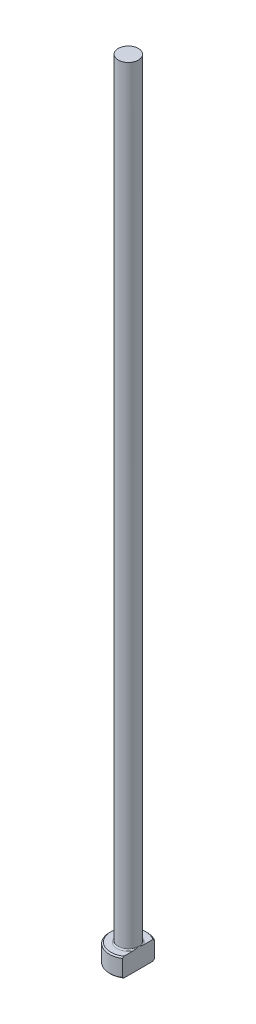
from build123d import *
from build123d.topology import SkipClean

# Parameters (mm, degrees)
CHAMFER1_SIZE = 0.2
FILLET1_R     = 0.2
KEY_DEPTH     = 126.071979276


with BuildPart() as part:
    # Sketch1 → Revolve1 (revolve)
    with BuildSketch(Plane.XY, mode=Mode.PRIVATE) as revolve1_sk:
        Polygon((0, 0), (-3, 0), (-3, 3), (-1.6, 3), (-1.6, 125), (0, 125), align=None)
    revolve(revolve1_sk.sketch.rotate(Axis((0, 259.958771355, 0), (0, -1, 0)), 270), axis=Axis((0, 259.958771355, 0), (0, -1, 0)))

    # Chamfer1
    chamfer1_edges = [part.edges().sort_by_distance(p)[0] for p in [
        (0, 3, -3),
        (0, 0, -3),
    ]]
    chamfer(chamfer1_edges, length=CHAMFER1_SIZE)

    # Fillet1
    fillet1_edges = [part.edges().sort_by_distance(p)[0] for p in [
        (0, 3, -1.6),
    ]]
    fillet(fillet1_edges, radius=FILLET1_R)

    # Sketch2 → KEY (cut, through all)
    with SkipClean():  # the faces are left unmerged after this step: merging them gives an invalid solid
        with BuildSketch(Plane(origin=(0, 0, 0), x_dir=(1, 0, 0), z_dir=(0, 1, 0))):
            with BuildLine():
                Line((1.6, 2.537715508), (1.6, -2.537715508))
                ThreePointArc((1.6, -2.537715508), (3, 0), (1.6, 2.537715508))
            make_face()
        extrude(amount=KEY_DEPTH, mode=Mode.SUBTRACT)


solid = part.part
